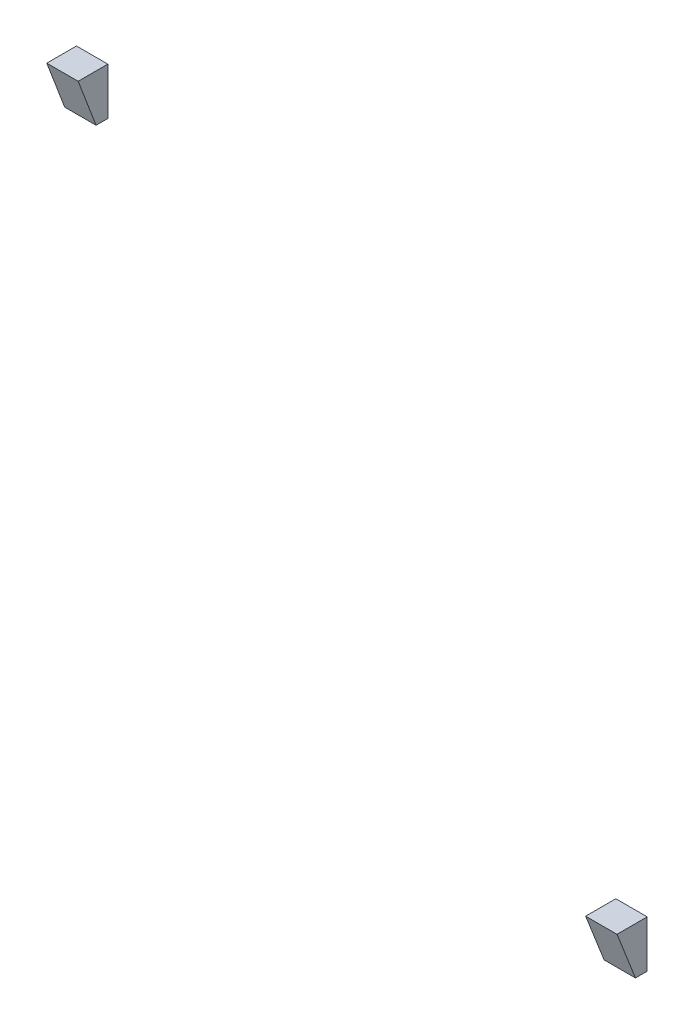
from build123d import *

# Parameters (mm, degrees)
SKETCH_1_W               = 4
SKETCH_1_H               = 6
EXTRUDE_1_DEPTH          = 5
EXTRUDE_1_2_DEPTH        = 5
CUT_EXTRUDE_1_DEPTH      = 81.778245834
CUT_EXTRUDE_1_DEPTH_BACK = 81.778245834
CUT_EXTRUDE_2_DEPTH      = 81.778245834
CUT_EXTRUDE_2_DEPTH_BACK = 81.778245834


with BuildPart() as part:
    # Sketch 1 → Extrude 1 (new body)
    with BuildSketch(Plane.XY):
        with Locations((-34, 31.75)):
            Rectangle(SKETCH_1_W, SKETCH_1_H)
    extrude(amount=EXTRUDE_1_DEPTH)

    # Sketch 2 → Cut-Extrude 1 (cut, two sides: drawn at the far end of the back side and taken through both)
    with BuildSketch(Plane.ZY.offset(36).offset(-CUT_EXTRUDE_1_DEPTH_BACK)):
        Polygon((-48.883322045, -103.708821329), (1.5, 28.75), (3.782218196, 34.75), (54.165540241, 167.208821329), (319.083182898, 66.442177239), (216.034320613, -204.475465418), align=None)
    extrude(amount=CUT_EXTRUDE_1_DEPTH + CUT_EXTRUDE_1_DEPTH_BACK, mode=Mode.SUBTRACT)


with BuildPart() as body_2:
    # Sketch 1 → Extrude 1 2 (new body)
    with BuildSketch(Plane.XY):
        with Locations((34.75, -28)):
            Rectangle(SKETCH_1_W, SKETCH_1_H)
    extrude(amount=EXTRUDE_1_2_DEPTH)

    # Sketch 4 → Cut-Extrude 2 (cut, two sides: drawn at the far end of the back side and taken through both)
    with BuildSketch(Plane(origin=(36.75, 0, 0), x_dir=(0, 0, -1), z_dir=(1, 0, 0)).offset(-CUT_EXTRUDE_2_DEPTH_BACK)):
        Polygon((-55.514364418, 106.930772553), (-3.849629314, -25), (-1.5, -31), (50.164735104, -162.930772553), (-213.696810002, -266.260242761), (-319.375909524, 3.601302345), align=None)
    extrude(amount=CUT_EXTRUDE_2_DEPTH + CUT_EXTRUDE_2_DEPTH_BACK, mode=Mode.SUBTRACT)


solid = Compound([part.part, body_2.part])
